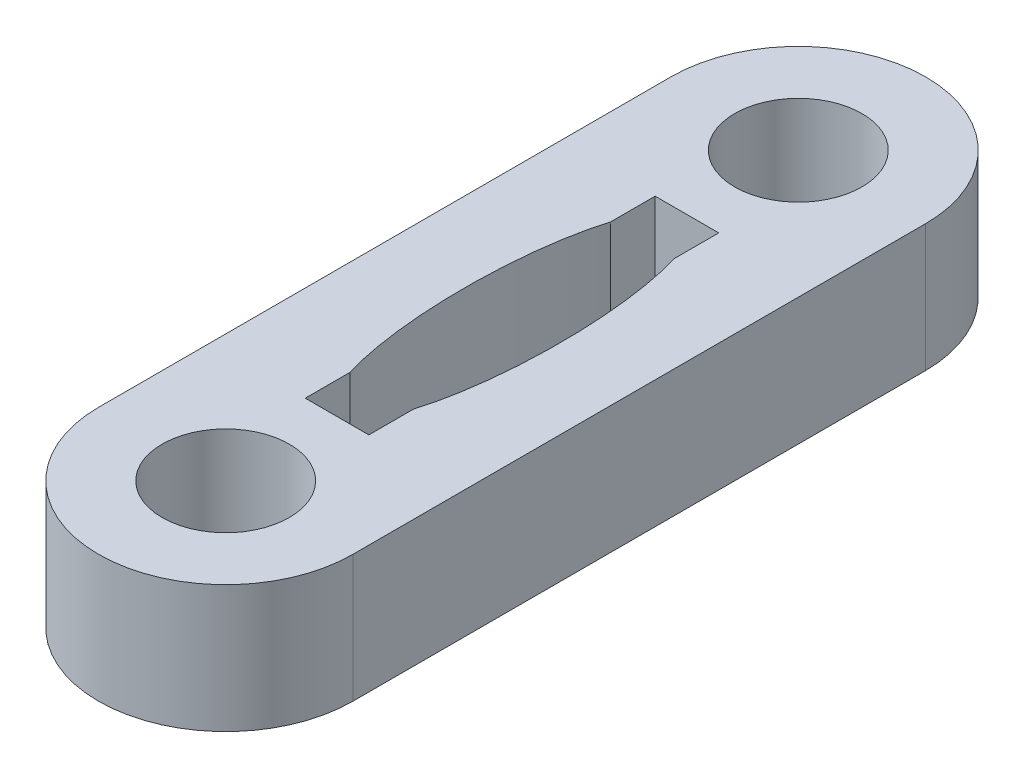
ISO-10303-21;
HEADER;
FILE_DESCRIPTION(('STEP AP214'),'2;1');
FILE_NAME('part.step','',(''),(''),'','','');
FILE_SCHEMA(('AUTOMOTIVE_DESIGN { 1 0 10303 214 1 1 1 1 }'));
ENDSEC;
DATA;
#1=APPLICATION_CONTEXT('core data for automotive mechanical design processes');
#2=APPLICATION_PROTOCOL_DEFINITION('international standard','automotive_design',2000,#1);
#3=PRODUCT_CONTEXT('',#1,'mechanical');
#4=PRODUCT('Part','Part','',(#3));
#5=PRODUCT_RELATED_PRODUCT_CATEGORY('part','',(#4));
#6=PRODUCT_DEFINITION_FORMATION('','',#4);
#7=PRODUCT_DEFINITION_CONTEXT('part definition',#1,'design');
#8=PRODUCT_DEFINITION('design','',#6,#7);
#9=PRODUCT_DEFINITION_SHAPE('','',#8);
#10=(LENGTH_UNIT() NAMED_UNIT(*) SI_UNIT(.MILLI.,.METRE.));
#11=(NAMED_UNIT(*) PLANE_ANGLE_UNIT() SI_UNIT($,.RADIAN.));
#12=(NAMED_UNIT(*) SI_UNIT($,.STERADIAN.) SOLID_ANGLE_UNIT());
#13=UNCERTAINTY_MEASURE_WITH_UNIT(LENGTH_MEASURE(1.E-05),#10,'distance_accuracy_value','');
#14=(GEOMETRIC_REPRESENTATION_CONTEXT(3) GLOBAL_UNCERTAINTY_ASSIGNED_CONTEXT((#13)) GLOBAL_UNIT_ASSIGNED_CONTEXT((#10,
#11,#12)) REPRESENTATION_CONTEXT('',''));
#15=CARTESIAN_POINT('',(0.,0.,0.));
#16=DIRECTION('',(0.,0.,1.));
#17=DIRECTION('',(1.,0.,0.));
#18=AXIS2_PLACEMENT_3D('',#15,#16,#17);
#19=CARTESIAN_POINT('',(0.,10.,45.));
#20=DIRECTION('',(0.,1.,0.));
#21=DIRECTION('',(0.,0.,1.));
#22=AXIS2_PLACEMENT_3D('',#19,#20,#21);
#23=PLANE('',#22);
#24=CARTESIAN_POINT('',(0.,10.,-45.));
#25=DIRECTION('',(0.,1.,0.));
#26=DIRECTION('',(0.,0.,1.));
#27=AXIS2_PLACEMENT_3D('',#24,#25,#26);
#28=CIRCLE('',#27,10.);
#29=CARTESIAN_POINT('',(0.,10.,-35.));
#30=VERTEX_POINT('',#29);
#31=EDGE_CURVE('E260',#30,#30,#28,.T.);
#32=ORIENTED_EDGE('',*,*,#31,.F.);
#33=EDGE_LOOP('',(#32));
#34=FACE_BOUND('',#33,.T.);
#35=CARTESIAN_POINT('',(0.,10.,45.));
#36=DIRECTION('',(0.,1.,0.));
#37=DIRECTION('',(0.,0.,1.));
#38=AXIS2_PLACEMENT_3D('',#35,#36,#37);
#39=CIRCLE('',#38,20.);
#40=CARTESIAN_POINT('',(-20.,10.,45.));
#41=VERTEX_POINT('',#40);
#42=CARTESIAN_POINT('',(20.,10.,45.));
#43=VERTEX_POINT('',#42);
#44=EDGE_CURVE('E210',#41,#43,#39,.T.);
#45=ORIENTED_EDGE('',*,*,#44,.T.);
#46=DIRECTION('',(0.,0.,-1.));
#47=VECTOR('',#46,1.);
#48=CARTESIAN_POINT('',(20.,10.,45.));
#49=LINE('',#48,#47);
#50=CARTESIAN_POINT('',(20.,10.,-45.));
#51=VERTEX_POINT('',#50);
#52=EDGE_CURVE('E224',#43,#51,#49,.T.);
#53=ORIENTED_EDGE('',*,*,#52,.T.);
#54=CARTESIAN_POINT('',(0.,10.,-45.));
#55=DIRECTION('',(0.,1.,0.));
#56=DIRECTION('',(0.,0.,1.));
#57=AXIS2_PLACEMENT_3D('',#54,#55,#56);
#58=CIRCLE('',#57,20.);
#59=CARTESIAN_POINT('',(-20.,10.,-45.));
#60=VERTEX_POINT('',#59);
#61=EDGE_CURVE('E204',#51,#60,#58,.T.);
#62=ORIENTED_EDGE('',*,*,#61,.T.);
#63=DIRECTION('',(0.,0.,1.));
#64=VECTOR('',#63,1.);
#65=CARTESIAN_POINT('',(-20.,10.,45.));
#66=LINE('',#65,#64);
#67=EDGE_CURVE('E217',#60,#41,#66,.T.);
#68=ORIENTED_EDGE('',*,*,#67,.T.);
#69=EDGE_LOOP('',(#45,#53,#62,#68));
#70=FACE_BOUND('',#69,.T.);
#71=DIRECTION('',(1.,0.,0.));
#72=VECTOR('',#71,1.);
#73=CARTESIAN_POINT('',(-5.,10.,27.5));
#74=LINE('',#73,#72);
#75=CARTESIAN_POINT('',(-5.,10.,27.5));
#76=VERTEX_POINT('',#75);
#77=CARTESIAN_POINT('',(5.,10.,27.5));
#78=VERTEX_POINT('',#77);
#79=EDGE_CURVE('E130',#76,#78,#74,.T.);
#80=ORIENTED_EDGE('',*,*,#79,.F.);
#81=DIRECTION('',(0.,0.,1.));
#82=VECTOR('',#81,1.);
#83=CARTESIAN_POINT('',(-5.,10.,27.5));
#84=LINE('',#83,#82);
#85=CARTESIAN_POINT('',(-4.99999999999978,10.,20.4972897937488));
#86=VERTEX_POINT('',#85);
#87=EDGE_CURVE('E122',#86,#76,#84,.T.);
#88=ORIENTED_EDGE('',*,*,#87,.F.);
#89=CARTESIAN_POINT('',(0.,10.,0.));
#90=DIRECTION('',(0.,1.,0.));
#91=DIRECTION('',(0.,0.,-1.));
#92=AXIS2_PLACEMENT_3D('',#89,#90,#91);
#93=ELLIPSE('',#92,27.5,7.5);
#94=CARTESIAN_POINT('',(-4.99999999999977,10.,-20.4972897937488));
#95=VERTEX_POINT('',#94);
#96=EDGE_CURVE('E240',#95,#86,#93,.T.);
#97=ORIENTED_EDGE('',*,*,#96,.F.);
#98=DIRECTION('',(0.,0.,1.));
#99=VECTOR('',#98,1.);
#100=CARTESIAN_POINT('',(-5.,10.,-27.5));
#101=LINE('',#100,#99);
#102=CARTESIAN_POINT('',(-5.,10.,-27.5));
#103=VERTEX_POINT('',#102);
#104=EDGE_CURVE('E263',#103,#95,#101,.T.);
#105=ORIENTED_EDGE('',*,*,#104,.F.);
#106=DIRECTION('',(-1.,0.,0.));
#107=VECTOR('',#106,1.);
#108=CARTESIAN_POINT('',(-5.,10.,-27.5));
#109=LINE('',#108,#107);
#110=CARTESIAN_POINT('',(5.,10.,-27.5));
#111=VERTEX_POINT('',#110);
#112=EDGE_CURVE('E291',#111,#103,#109,.T.);
#113=ORIENTED_EDGE('',*,*,#112,.F.);
#114=DIRECTION('',(0.,0.,-1.));
#115=VECTOR('',#114,1.);
#116=CARTESIAN_POINT('',(5.,10.,-27.5));
#117=LINE('',#116,#115);
#118=CARTESIAN_POINT('',(4.99999999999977,10.,-20.4972897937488));
#119=VERTEX_POINT('',#118);
#120=EDGE_CURVE('E152',#119,#111,#117,.T.);
#121=ORIENTED_EDGE('',*,*,#120,.F.);
#122=CARTESIAN_POINT('',(0.,10.,0.));
#123=DIRECTION('',(0.,1.,0.));
#124=DIRECTION('',(0.,0.,-1.));
#125=AXIS2_PLACEMENT_3D('',#122,#123,#124);
#126=ELLIPSE('',#125,27.5,7.5);
#127=CARTESIAN_POINT('',(4.99999999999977,10.,20.4972897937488));
#128=VERTEX_POINT('',#127);
#129=EDGE_CURVE('E146',#128,#119,#126,.T.);
#130=ORIENTED_EDGE('',*,*,#129,.F.);
#131=DIRECTION('',(0.,0.,-1.));
#132=VECTOR('',#131,1.);
#133=CARTESIAN_POINT('',(5.,10.,27.5));
#134=LINE('',#133,#132);
#135=EDGE_CURVE('E144',#78,#128,#134,.T.);
#136=ORIENTED_EDGE('',*,*,#135,.F.);
#137=EDGE_LOOP('',(#80,#88,#97,#105,#113,#121,#130,#136));
#138=FACE_BOUND('',#137,.T.);
#139=CARTESIAN_POINT('',(0.,10.,45.));
#140=DIRECTION('',(0.,1.,0.));
#141=DIRECTION('',(0.,0.,1.));
#142=AXIS2_PLACEMENT_3D('',#139,#140,#141);
#143=CIRCLE('',#142,10.);
#144=CARTESIAN_POINT('',(0.,10.,55.));
#145=VERTEX_POINT('',#144);
#146=EDGE_CURVE('E299',#145,#145,#143,.T.);
#147=ORIENTED_EDGE('',*,*,#146,.F.);
#148=EDGE_LOOP('',(#147));
#149=FACE_BOUND('',#148,.T.);
#150=ADVANCED_FACE('F33',(#34,#70,#138,#149),#23,.T.);
#151=CARTESIAN_POINT('',(0.,-10.,45.));
#152=DIRECTION('',(0.,1.,0.));
#153=DIRECTION('',(0.,0.,1.));
#154=AXIS2_PLACEMENT_3D('',#151,#152,#153);
#155=PLANE('',#154);
#156=CARTESIAN_POINT('',(0.,-10.,-45.));
#157=DIRECTION('',(0.,1.,0.));
#158=DIRECTION('',(0.,0.,1.));
#159=AXIS2_PLACEMENT_3D('',#156,#157,#158);
#160=CIRCLE('',#159,10.);
#161=CARTESIAN_POINT('',(0.,-10.,-35.));
#162=VERTEX_POINT('',#161);
#163=EDGE_CURVE('E302',#162,#162,#160,.T.);
#164=ORIENTED_EDGE('',*,*,#163,.T.);
#165=EDGE_LOOP('',(#164));
#166=FACE_BOUND('',#165,.T.);
#167=CARTESIAN_POINT('',(0.,-10.,45.));
#168=DIRECTION('',(0.,1.,0.));
#169=DIRECTION('',(0.,0.,1.));
#170=AXIS2_PLACEMENT_3D('',#167,#168,#169);
#171=CIRCLE('',#170,20.);
#172=CARTESIAN_POINT('',(-20.,-10.,45.));
#173=VERTEX_POINT('',#172);
#174=CARTESIAN_POINT('',(20.,-10.,45.));
#175=VERTEX_POINT('',#174);
#176=EDGE_CURVE('E138',#173,#175,#171,.T.);
#177=ORIENTED_EDGE('',*,*,#176,.F.);
#178=DIRECTION('',(0.,0.,1.));
#179=VECTOR('',#178,1.);
#180=CARTESIAN_POINT('',(-20.,-10.,45.));
#181=LINE('',#180,#179);
#182=CARTESIAN_POINT('',(-20.,-10.,-45.));
#183=VERTEX_POINT('',#182);
#184=EDGE_CURVE('E208',#183,#173,#181,.T.);
#185=ORIENTED_EDGE('',*,*,#184,.F.);
#186=CARTESIAN_POINT('',(0.,-10.,-45.));
#187=DIRECTION('',(0.,1.,0.));
#188=DIRECTION('',(0.,0.,1.));
#189=AXIS2_PLACEMENT_3D('',#186,#187,#188);
#190=CIRCLE('',#189,20.);
#191=CARTESIAN_POINT('',(20.,-10.,-45.));
#192=VERTEX_POINT('',#191);
#193=EDGE_CURVE('E200',#192,#183,#190,.T.);
#194=ORIENTED_EDGE('',*,*,#193,.F.);
#195=DIRECTION('',(0.,0.,-1.));
#196=VECTOR('',#195,1.);
#197=CARTESIAN_POINT('',(20.,-10.,45.));
#198=LINE('',#197,#196);
#199=EDGE_CURVE('E192',#175,#192,#198,.T.);
#200=ORIENTED_EDGE('',*,*,#199,.F.);
#201=EDGE_LOOP('',(#177,#185,#194,#200));
#202=FACE_BOUND('',#201,.T.);
#203=DIRECTION('',(0.,0.,1.));
#204=VECTOR('',#203,1.);
#205=CARTESIAN_POINT('',(-5.,-10.,27.5));
#206=LINE('',#205,#204);
#207=CARTESIAN_POINT('',(-4.99999999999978,-10.,20.4972897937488));
#208=VERTEX_POINT('',#207);
#209=CARTESIAN_POINT('',(-5.,-10.,27.5));
#210=VERTEX_POINT('',#209);
#211=EDGE_CURVE('E56',#208,#210,#206,.T.);
#212=ORIENTED_EDGE('',*,*,#211,.T.);
#213=DIRECTION('',(1.,0.,0.));
#214=VECTOR('',#213,1.);
#215=CARTESIAN_POINT('',(-5.,-10.,27.5));
#216=LINE('',#215,#214);
#217=CARTESIAN_POINT('',(5.,-10.,27.5));
#218=VERTEX_POINT('',#217);
#219=EDGE_CURVE('E137',#210,#218,#216,.T.);
#220=ORIENTED_EDGE('',*,*,#219,.T.);
#221=DIRECTION('',(0.,0.,-1.));
#222=VECTOR('',#221,1.);
#223=CARTESIAN_POINT('',(5.,-10.,27.5));
#224=LINE('',#223,#222);
#225=CARTESIAN_POINT('',(4.99999999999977,-10.,20.4972897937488));
#226=VERTEX_POINT('',#225);
#227=EDGE_CURVE('E255',#218,#226,#224,.T.);
#228=ORIENTED_EDGE('',*,*,#227,.T.);
#229=CARTESIAN_POINT('',(0.,-10.,0.));
#230=DIRECTION('',(0.,1.,0.));
#231=DIRECTION('',(0.,0.,-1.));
#232=AXIS2_PLACEMENT_3D('',#229,#230,#231);
#233=ELLIPSE('',#232,27.5,7.5);
#234=CARTESIAN_POINT('',(4.99999999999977,-10.,-20.4972897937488));
#235=VERTEX_POINT('',#234);
#236=EDGE_CURVE('E252',#226,#235,#233,.T.);
#237=ORIENTED_EDGE('',*,*,#236,.T.);
#238=DIRECTION('',(0.,0.,-1.));
#239=VECTOR('',#238,1.);
#240=CARTESIAN_POINT('',(5.,-10.,-27.5));
#241=LINE('',#240,#239);
#242=CARTESIAN_POINT('',(5.,-10.,-27.5));
#243=VERTEX_POINT('',#242);
#244=EDGE_CURVE('E249',#235,#243,#241,.T.);
#245=ORIENTED_EDGE('',*,*,#244,.T.);
#246=DIRECTION('',(-1.,0.,0.));
#247=VECTOR('',#246,1.);
#248=CARTESIAN_POINT('',(-5.,-10.,-27.5));
#249=LINE('',#248,#247);
#250=CARTESIAN_POINT('',(-5.,-10.,-27.5));
#251=VERTEX_POINT('',#250);
#252=EDGE_CURVE('E246',#243,#251,#249,.T.);
#253=ORIENTED_EDGE('',*,*,#252,.T.);
#254=DIRECTION('',(0.,0.,1.));
#255=VECTOR('',#254,1.);
#256=CARTESIAN_POINT('',(-5.,-10.,-27.5));
#257=LINE('',#256,#255);
#258=CARTESIAN_POINT('',(-4.99999999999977,-10.,-20.4972897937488));
#259=VERTEX_POINT('',#258);
#260=EDGE_CURVE('E243',#251,#259,#257,.T.);
#261=ORIENTED_EDGE('',*,*,#260,.T.);
#262=CARTESIAN_POINT('',(0.,-10.,0.));
#263=DIRECTION('',(0.,1.,0.));
#264=DIRECTION('',(0.,0.,-1.));
#265=AXIS2_PLACEMENT_3D('',#262,#263,#264);
#266=ELLIPSE('',#265,27.5,7.5);
#267=EDGE_CURVE('E131',#259,#208,#266,.T.);
#268=ORIENTED_EDGE('',*,*,#267,.T.);
#269=EDGE_LOOP('',(#212,#220,#228,#237,#245,#253,#261,#268));
#270=FACE_BOUND('',#269,.T.);
#271=CARTESIAN_POINT('',(0.,-10.,45.));
#272=DIRECTION('',(0.,1.,0.));
#273=DIRECTION('',(0.,0.,1.));
#274=AXIS2_PLACEMENT_3D('',#271,#272,#273);
#275=CIRCLE('',#274,10.);
#276=CARTESIAN_POINT('',(0.,-10.,55.));
#277=VERTEX_POINT('',#276);
#278=EDGE_CURVE('E297',#277,#277,#275,.T.);
#279=ORIENTED_EDGE('',*,*,#278,.T.);
#280=EDGE_LOOP('',(#279));
#281=FACE_BOUND('',#280,.T.);
#282=ADVANCED_FACE('F173',(#166,#202,#270,#281),#155,.F.);
#283=CARTESIAN_POINT('',(0.,10.,45.));
#284=DIRECTION('',(0.,-1.,0.));
#285=DIRECTION('',(0.,0.,-1.));
#286=AXIS2_PLACEMENT_3D('',#283,#284,#285);
#287=CYLINDRICAL_SURFACE('',#286,20.);
#288=ORIENTED_EDGE('',*,*,#176,.T.);
#289=DIRECTION('',(0.,-1.,0.));
#290=VECTOR('',#289,1.);
#291=CARTESIAN_POINT('',(20.,10.,45.));
#292=LINE('',#291,#290);
#293=EDGE_CURVE('E11',#43,#175,#292,.T.);
#294=ORIENTED_EDGE('',*,*,#293,.F.);
#295=ORIENTED_EDGE('',*,*,#44,.F.);
#296=DIRECTION('',(0.,-1.,0.));
#297=VECTOR('',#296,1.);
#298=CARTESIAN_POINT('',(-20.,10.,45.));
#299=LINE('',#298,#297);
#300=EDGE_CURVE('E214',#41,#173,#299,.T.);
#301=ORIENTED_EDGE('',*,*,#300,.T.);
#302=EDGE_LOOP('',(#288,#294,#295,#301));
#303=FACE_BOUND('',#302,.T.);
#304=ADVANCED_FACE('F35',(#303),#287,.T.);
#305=CARTESIAN_POINT('',(20.,10.,45.));
#306=DIRECTION('',(-1.,0.,0.));
#307=DIRECTION('',(0.,0.,1.));
#308=AXIS2_PLACEMENT_3D('',#305,#306,#307);
#309=PLANE('',#308);
#310=ORIENTED_EDGE('',*,*,#199,.T.);
#311=DIRECTION('',(0.,-1.,0.));
#312=VECTOR('',#311,1.);
#313=CARTESIAN_POINT('',(20.,10.,-45.));
#314=LINE('',#313,#312);
#315=EDGE_CURVE('E41',#51,#192,#314,.T.);
#316=ORIENTED_EDGE('',*,*,#315,.F.);
#317=ORIENTED_EDGE('',*,*,#52,.F.);
#318=ORIENTED_EDGE('',*,*,#293,.T.);
#319=EDGE_LOOP('',(#310,#316,#317,#318));
#320=FACE_BOUND('',#319,.T.);
#321=ADVANCED_FACE('F183',(#320),#309,.F.);
#322=CARTESIAN_POINT('',(0.,10.,-45.));
#323=DIRECTION('',(0.,-1.,0.));
#324=DIRECTION('',(0.,0.,-1.));
#325=AXIS2_PLACEMENT_3D('',#322,#323,#324);
#326=CYLINDRICAL_SURFACE('',#325,20.);
#327=ORIENTED_EDGE('',*,*,#193,.T.);
#328=DIRECTION('',(0.,-1.,0.));
#329=VECTOR('',#328,1.);
#330=CARTESIAN_POINT('',(-20.,10.,-45.));
#331=LINE('',#330,#329);
#332=EDGE_CURVE('E205',#60,#183,#331,.T.);
#333=ORIENTED_EDGE('',*,*,#332,.F.);
#334=ORIENTED_EDGE('',*,*,#61,.F.);
#335=ORIENTED_EDGE('',*,*,#315,.T.);
#336=EDGE_LOOP('',(#327,#333,#334,#335));
#337=FACE_BOUND('',#336,.T.);
#338=ADVANCED_FACE('F180',(#337),#326,.T.);
#339=CARTESIAN_POINT('',(-20.,10.,45.));
#340=DIRECTION('',(1.,0.,0.));
#341=DIRECTION('',(0.,0.,-1.));
#342=AXIS2_PLACEMENT_3D('',#339,#340,#341);
#343=PLANE('',#342);
#344=ORIENTED_EDGE('',*,*,#184,.T.);
#345=ORIENTED_EDGE('',*,*,#300,.F.);
#346=ORIENTED_EDGE('',*,*,#67,.F.);
#347=ORIENTED_EDGE('',*,*,#332,.T.);
#348=EDGE_LOOP('',(#344,#345,#346,#347));
#349=FACE_BOUND('',#348,.T.);
#350=ADVANCED_FACE('F170',(#349),#343,.F.);
#351=CARTESIAN_POINT('',(-5.,10.,27.5));
#352=DIRECTION('',(1.,0.,0.));
#353=DIRECTION('',(0.,0.,-1.));
#354=AXIS2_PLACEMENT_3D('',#351,#352,#353);
#355=PLANE('',#354);
#356=ORIENTED_EDGE('',*,*,#211,.F.);
#357=DIRECTION('',(0.,-1.,0.));
#358=VECTOR('',#357,1.);
#359=CARTESIAN_POINT('',(-4.99999999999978,10.,20.4972897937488));
#360=LINE('',#359,#358);
#361=EDGE_CURVE('E126',#86,#208,#360,.T.);
#362=ORIENTED_EDGE('',*,*,#361,.F.);
#363=ORIENTED_EDGE('',*,*,#87,.T.);
#364=DIRECTION('',(0.,-1.,0.));
#365=VECTOR('',#364,1.);
#366=CARTESIAN_POINT('',(-5.,10.,27.5));
#367=LINE('',#366,#365);
#368=EDGE_CURVE('E125',#76,#210,#367,.T.);
#369=ORIENTED_EDGE('',*,*,#368,.T.);
#370=EDGE_LOOP('',(#356,#362,#363,#369));
#371=FACE_BOUND('',#370,.T.);
#372=ADVANCED_FACE('F124',(#371),#355,.T.);
#373=CARTESIAN_POINT('',(-5.,10.,27.5));
#374=DIRECTION('',(0.,0.,-1.));
#375=DIRECTION('',(-1.,0.,0.));
#376=AXIS2_PLACEMENT_3D('',#373,#374,#375);
#377=PLANE('',#376);
#378=ORIENTED_EDGE('',*,*,#219,.F.);
#379=ORIENTED_EDGE('',*,*,#368,.F.);
#380=ORIENTED_EDGE('',*,*,#79,.T.);
#381=DIRECTION('',(0.,-1.,0.));
#382=VECTOR('',#381,1.);
#383=CARTESIAN_POINT('',(5.,10.,27.5));
#384=LINE('',#383,#382);
#385=EDGE_CURVE('E139',#78,#218,#384,.T.);
#386=ORIENTED_EDGE('',*,*,#385,.T.);
#387=EDGE_LOOP('',(#378,#379,#380,#386));
#388=FACE_BOUND('',#387,.T.);
#389=ADVANCED_FACE('F134',(#388),#377,.T.);
#390=CARTESIAN_POINT('',(5.,10.,27.5));
#391=DIRECTION('',(-1.,0.,0.));
#392=DIRECTION('',(0.,0.,1.));
#393=AXIS2_PLACEMENT_3D('',#390,#391,#392);
#394=PLANE('',#393);
#395=ORIENTED_EDGE('',*,*,#227,.F.);
#396=ORIENTED_EDGE('',*,*,#385,.F.);
#397=ORIENTED_EDGE('',*,*,#135,.T.);
#398=DIRECTION('',(0.,-1.,0.));
#399=VECTOR('',#398,1.);
#400=CARTESIAN_POINT('',(4.99999999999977,10.,20.4972897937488));
#401=LINE('',#400,#399);
#402=EDGE_CURVE('E230',#128,#226,#401,.T.);
#403=ORIENTED_EDGE('',*,*,#402,.T.);
#404=EDGE_LOOP('',(#395,#396,#397,#403));
#405=FACE_BOUND('',#404,.T.);
#406=ADVANCED_FACE('F160',(#405),#394,.T.);
#407=DIRECTION('',(0.,-1.,0.));
#408=VECTOR('',#407,1.);
#409=SURFACE_OF_LINEAR_EXTRUSION('',#126,#408);
#410=ORIENTED_EDGE('',*,*,#236,.F.);
#411=ORIENTED_EDGE('',*,*,#402,.F.);
#412=ORIENTED_EDGE('',*,*,#129,.T.);
#413=DIRECTION('',(0.,-1.,0.));
#414=VECTOR('',#413,1.);
#415=CARTESIAN_POINT('',(4.99999999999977,10.,-20.4972897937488));
#416=LINE('',#415,#414);
#417=EDGE_CURVE('E232',#119,#235,#416,.T.);
#418=ORIENTED_EDGE('',*,*,#417,.T.);
#419=EDGE_LOOP('',(#410,#411,#412,#418));
#420=FACE_BOUND('',#419,.T.);
#421=ADVANCED_FACE('F155',(#420),#409,.T.);
#422=CARTESIAN_POINT('',(5.,10.,-27.5));
#423=DIRECTION('',(-1.,0.,0.));
#424=DIRECTION('',(0.,0.,1.));
#425=AXIS2_PLACEMENT_3D('',#422,#423,#424);
#426=PLANE('',#425);
#427=ORIENTED_EDGE('',*,*,#244,.F.);
#428=ORIENTED_EDGE('',*,*,#417,.F.);
#429=ORIENTED_EDGE('',*,*,#120,.T.);
#430=DIRECTION('',(0.,-1.,0.));
#431=VECTOR('',#430,1.);
#432=CARTESIAN_POINT('',(5.,10.,-27.5));
#433=LINE('',#432,#431);
#434=EDGE_CURVE('E234',#111,#243,#433,.T.);
#435=ORIENTED_EDGE('',*,*,#434,.T.);
#436=EDGE_LOOP('',(#427,#428,#429,#435));
#437=FACE_BOUND('',#436,.T.);
#438=ADVANCED_FACE('F159',(#437),#426,.T.);
#439=CARTESIAN_POINT('',(-5.,10.,-27.5));
#440=DIRECTION('',(0.,0.,1.));
#441=DIRECTION('',(1.,0.,0.));
#442=AXIS2_PLACEMENT_3D('',#439,#440,#441);
#443=PLANE('',#442);
#444=ORIENTED_EDGE('',*,*,#252,.F.);
#445=ORIENTED_EDGE('',*,*,#434,.F.);
#446=ORIENTED_EDGE('',*,*,#112,.T.);
#447=DIRECTION('',(0.,-1.,0.));
#448=VECTOR('',#447,1.);
#449=CARTESIAN_POINT('',(-5.,10.,-27.5));
#450=LINE('',#449,#448);
#451=EDGE_CURVE('E236',#103,#251,#450,.T.);
#452=ORIENTED_EDGE('',*,*,#451,.T.);
#453=EDGE_LOOP('',(#444,#445,#446,#452));
#454=FACE_BOUND('',#453,.T.);
#455=ADVANCED_FACE('F273',(#454),#443,.T.);
#456=CARTESIAN_POINT('',(-5.,10.,-27.5));
#457=DIRECTION('',(1.,0.,0.));
#458=DIRECTION('',(0.,0.,-1.));
#459=AXIS2_PLACEMENT_3D('',#456,#457,#458);
#460=PLANE('',#459);
#461=ORIENTED_EDGE('',*,*,#260,.F.);
#462=ORIENTED_EDGE('',*,*,#451,.F.);
#463=ORIENTED_EDGE('',*,*,#104,.T.);
#464=DIRECTION('',(0.,-1.,0.));
#465=VECTOR('',#464,1.);
#466=CARTESIAN_POINT('',(-4.99999999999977,10.,-20.4972897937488));
#467=LINE('',#466,#465);
#468=EDGE_CURVE('E48',#95,#259,#467,.T.);
#469=ORIENTED_EDGE('',*,*,#468,.T.);
#470=EDGE_LOOP('',(#461,#462,#463,#469));
#471=FACE_BOUND('',#470,.T.);
#472=ADVANCED_FACE('F270',(#471),#460,.T.);
#473=DIRECTION('',(0.,-1.,0.));
#474=VECTOR('',#473,1.);
#475=SURFACE_OF_LINEAR_EXTRUSION('',#93,#474);
#476=ORIENTED_EDGE('',*,*,#267,.F.);
#477=ORIENTED_EDGE('',*,*,#468,.F.);
#478=ORIENTED_EDGE('',*,*,#96,.T.);
#479=ORIENTED_EDGE('',*,*,#361,.T.);
#480=EDGE_LOOP('',(#476,#477,#478,#479));
#481=FACE_BOUND('',#480,.T.);
#482=ADVANCED_FACE('F265',(#481),#475,.T.);
#483=CARTESIAN_POINT('',(0.,10.,-45.));
#484=DIRECTION('',(0.,-1.,0.));
#485=DIRECTION('',(0.,0.,-1.));
#486=AXIS2_PLACEMENT_3D('',#483,#484,#485);
#487=CYLINDRICAL_SURFACE('',#486,10.);
#488=ORIENTED_EDGE('',*,*,#31,.T.);
#489=EDGE_LOOP('',(#488));
#490=FACE_BOUND('',#489,.T.);
#491=ORIENTED_EDGE('',*,*,#163,.F.);
#492=EDGE_LOOP('',(#491));
#493=FACE_BOUND('',#492,.T.);
#494=ADVANCED_FACE('F269',(#490,#493),#487,.F.);
#495=CARTESIAN_POINT('',(0.,10.,45.));
#496=DIRECTION('',(0.,-1.,0.));
#497=DIRECTION('',(0.,0.,-1.));
#498=AXIS2_PLACEMENT_3D('',#495,#496,#497);
#499=CYLINDRICAL_SURFACE('',#498,10.);
#500=ORIENTED_EDGE('',*,*,#146,.T.);
#501=EDGE_LOOP('',(#500));
#502=FACE_BOUND('',#501,.T.);
#503=ORIENTED_EDGE('',*,*,#278,.F.);
#504=EDGE_LOOP('',(#503));
#505=FACE_BOUND('',#504,.T.);
#506=ADVANCED_FACE('F310',(#502,#505),#499,.F.);
#507=CLOSED_SHELL('',(#150,#282,#304,#321,#338,#350,#372,#389,#406,#421,#438,#455,#472,#482,
#494,#506));
#508=MANIFOLD_SOLID_BREP('B2',#507);
#509=ADVANCED_BREP_SHAPE_REPRESENTATION('',(#18,#508),#14);
#510=SHAPE_DEFINITION_REPRESENTATION(#9,#509);
ENDSEC;
END-ISO-10303-21;
